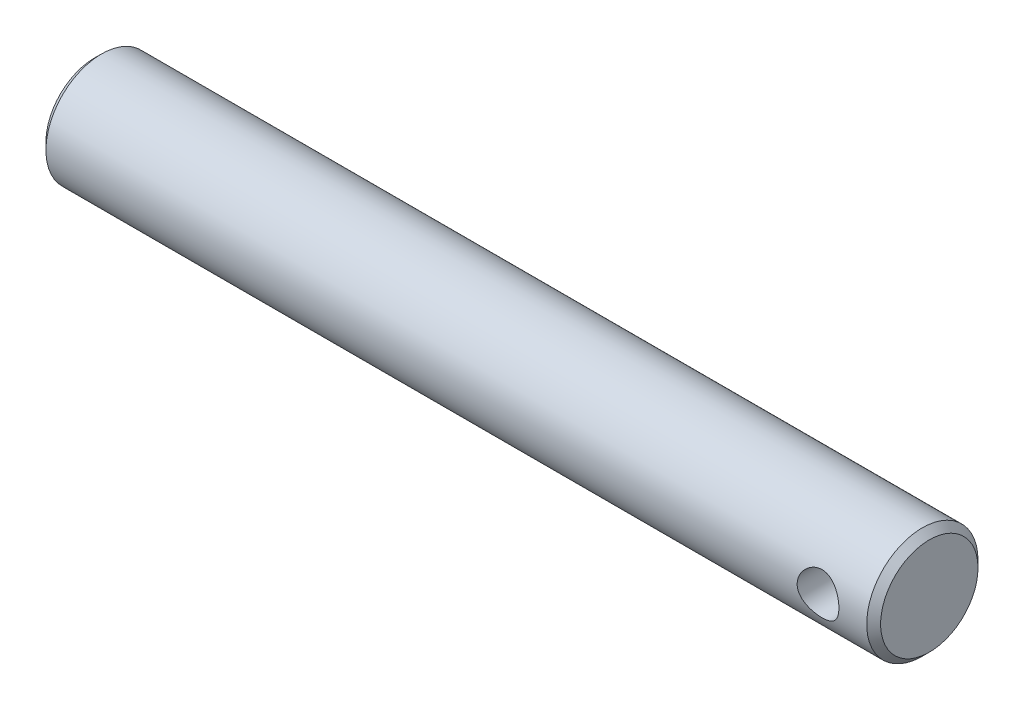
ISO-10303-21;
HEADER;
FILE_DESCRIPTION(('STEP AP214'),'2;1');
FILE_NAME('part.step','',(''),(''),'','','');
FILE_SCHEMA(('AUTOMOTIVE_DESIGN { 1 0 10303 214 1 1 1 1 }'));
ENDSEC;
DATA;
#1=APPLICATION_CONTEXT('core data for automotive mechanical design processes');
#2=APPLICATION_PROTOCOL_DEFINITION('international standard','automotive_design',2000,#1);
#3=PRODUCT_CONTEXT('',#1,'mechanical');
#4=PRODUCT('Part','Part','',(#3));
#5=PRODUCT_RELATED_PRODUCT_CATEGORY('part','',(#4));
#6=PRODUCT_DEFINITION_FORMATION('','',#4);
#7=PRODUCT_DEFINITION_CONTEXT('part definition',#1,'design');
#8=PRODUCT_DEFINITION('design','',#6,#7);
#9=PRODUCT_DEFINITION_SHAPE('','',#8);
#10=(LENGTH_UNIT() NAMED_UNIT(*) SI_UNIT(.MILLI.,.METRE.));
#11=(NAMED_UNIT(*) PLANE_ANGLE_UNIT() SI_UNIT($,.RADIAN.));
#12=(NAMED_UNIT(*) SI_UNIT($,.STERADIAN.) SOLID_ANGLE_UNIT());
#13=UNCERTAINTY_MEASURE_WITH_UNIT(LENGTH_MEASURE(1.E-05),#10,'distance_accuracy_value','');
#14=(GEOMETRIC_REPRESENTATION_CONTEXT(3) GLOBAL_UNCERTAINTY_ASSIGNED_CONTEXT((#13)) GLOBAL_UNIT_ASSIGNED_CONTEXT((#10,
#11,#12)) REPRESENTATION_CONTEXT('',''));
#15=CARTESIAN_POINT('',(0.,0.,0.));
#16=DIRECTION('',(0.,0.,1.));
#17=DIRECTION('',(1.,0.,0.));
#18=AXIS2_PLACEMENT_3D('',#15,#16,#17);
#19=CARTESIAN_POINT('',(95.25,0.,0.));
#20=DIRECTION('',(-1.,0.,0.));
#21=DIRECTION('',(0.,0.,1.));
#22=AXIS2_PLACEMENT_3D('',#19,#20,#21);
#23=CYLINDRICAL_SURFACE('',#22,6.35);
#24=CARTESIAN_POINT('',(94.45625,0.,0.));
#25=DIRECTION('',(1.,0.,0.));
#26=DIRECTION('',(0.,0.,-1.));
#27=AXIS2_PLACEMENT_3D('',#24,#25,#26);
#28=CIRCLE('',#27,6.35);
#29=CARTESIAN_POINT('',(94.45625,0.,-6.35));
#30=VERTEX_POINT('',#29);
#31=EDGE_CURVE('E33',#30,#30,#28,.F.);
#32=ORIENTED_EDGE('',*,*,#31,.T.);
#33=EDGE_LOOP('',(#32));
#34=FACE_BOUND('',#33,.T.);
#35=CARTESIAN_POINT('',(0.793750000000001,0.,0.));
#36=DIRECTION('',(1.,0.,0.));
#37=DIRECTION('',(0.,0.,-1.));
#38=AXIS2_PLACEMENT_3D('',#35,#36,#37);
#39=CIRCLE('',#38,6.35);
#40=CARTESIAN_POINT('',(0.793750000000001,0.,-6.35));
#41=VERTEX_POINT('',#40);
#42=EDGE_CURVE('E37',#41,#41,#39,.T.);
#43=ORIENTED_EDGE('',*,*,#42,.T.);
#44=EDGE_LOOP('',(#43));
#45=FACE_BOUND('',#44,.T.);
#46=CARTESIAN_POINT('',(91.28125,0.,-6.35));
#47=CARTESIAN_POINT('',(91.2812546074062,0.128960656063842,-6.3500034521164));
#48=CARTESIAN_POINT('',(91.2707411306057,0.257889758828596,-6.34603727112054));
#49=CARTESIAN_POINT('',(91.229135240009,0.511894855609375,-6.33061179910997));
#50=CARTESIAN_POINT('',(91.198045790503,0.636971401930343,-6.31915358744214));
#51=CARTESIAN_POINT('',(91.1165421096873,0.879571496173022,-6.28997396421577));
#52=CARTESIAN_POINT('',(91.0661651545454,0.997109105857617,-6.27226463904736));
#53=CARTESIAN_POINT('',(90.9477060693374,1.2220564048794,-6.23234668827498));
#54=CARTESIAN_POINT('',(90.8796191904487,1.32946336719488,-6.21013685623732));
#55=CARTESIAN_POINT('',(90.7246526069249,1.53566243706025,-6.16245667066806));
#56=CARTESIAN_POINT('',(90.6371532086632,1.63396728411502,-6.13689404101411));
#57=CARTESIAN_POINT('',(90.4471609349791,1.81490019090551,-6.08584350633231));
#58=CARTESIAN_POINT('',(90.3446634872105,1.89752345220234,-6.06035562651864));
#59=CARTESIAN_POINT('',(90.1228235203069,2.04784646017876,-6.01126672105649));
#60=CARTESIAN_POINT('',(90.0029880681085,2.11485786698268,-5.98777455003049));
#61=CARTESIAN_POINT('',(89.7527282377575,2.22755851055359,-5.94677278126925));
#62=CARTESIAN_POINT('',(89.6223081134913,2.27325626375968,-5.92926079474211));
#63=CARTESIAN_POINT('',(89.3601896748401,2.3401088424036,-5.90318880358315));
#64=CARTESIAN_POINT('',(89.2287632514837,2.36219354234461,-5.89429104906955));
#65=CARTESIAN_POINT('',(88.9637918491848,2.38410045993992,-5.88546672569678));
#66=CARTESIAN_POINT('',(88.8302477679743,2.38393187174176,-5.88553645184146));
#67=CARTESIAN_POINT('',(88.5733408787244,2.36204807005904,-5.89434799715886));
#68=CARTESIAN_POINT('',(88.4498470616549,2.34162296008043,-5.90257056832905));
#69=CARTESIAN_POINT('',(88.2081878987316,2.28193866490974,-5.92589839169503));
#70=CARTESIAN_POINT('',(88.0900233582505,2.24267664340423,-5.94100468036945));
#71=CARTESIAN_POINT('',(87.8597476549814,2.14572450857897,-5.97671052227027));
#72=CARTESIAN_POINT('',(87.7477933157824,2.08769979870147,-5.99740859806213));
#73=CARTESIAN_POINT('',(87.5348361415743,1.95510267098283,-6.04193308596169));
#74=CARTESIAN_POINT('',(87.4338371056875,1.88052453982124,-6.06576057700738));
#75=CARTESIAN_POINT('',(87.2385166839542,1.71103576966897,-6.11581261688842));
#76=CARTESIAN_POINT('',(87.1451002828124,1.61509549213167,-6.14209064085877));
#77=CARTESIAN_POINT('',(86.9754134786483,1.4086087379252,-6.19270618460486));
#78=CARTESIAN_POINT('',(86.8991457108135,1.29806002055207,-6.21704340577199));
#79=CARTESIAN_POINT('',(86.7649229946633,1.06318595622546,-6.26151901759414));
#80=CARTESIAN_POINT('',(86.7072694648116,0.938674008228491,-6.2815866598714));
#81=CARTESIAN_POINT('',(86.6140276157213,0.680778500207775,-6.31473715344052));
#82=CARTESIAN_POINT('',(86.5784294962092,0.547398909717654,-6.3278231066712));
#83=CARTESIAN_POINT('',(86.5320488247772,0.283170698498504,-6.34499053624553));
#84=CARTESIAN_POINT('',(86.5200476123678,0.152564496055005,-6.34951373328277));
#85=CARTESIAN_POINT('',(86.5176529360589,-0.108858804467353,-6.3504110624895));
#86=CARTESIAN_POINT('',(86.5272546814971,-0.239675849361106,-6.34678700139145));
#87=CARTESIAN_POINT('',(86.566867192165,-0.492541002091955,-6.33208839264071));
#88=CARTESIAN_POINT('',(86.5960795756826,-0.614732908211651,-6.32130547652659));
#89=CARTESIAN_POINT('',(86.6730328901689,-0.852395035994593,-6.29366719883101));
#90=CARTESIAN_POINT('',(86.7207762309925,-0.967864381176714,-6.27681104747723));
#91=CARTESIAN_POINT('',(86.8349584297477,-1.19260582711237,-6.23807528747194));
#92=CARTESIAN_POINT('',(86.9019053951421,-1.30159614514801,-6.2160626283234));
#93=CARTESIAN_POINT('',(87.0520199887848,-1.50716092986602,-6.16944841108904));
#94=CARTESIAN_POINT('',(87.1351936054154,-1.60373079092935,-6.14484589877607));
#95=CARTESIAN_POINT('',(87.3210790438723,-1.78757389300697,-6.09398910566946));
#96=CARTESIAN_POINT('',(87.4246444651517,-1.87398269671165,-6.0677218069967));
#97=CARTESIAN_POINT('',(87.6453215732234,-2.02836541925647,-6.0178761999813));
#98=CARTESIAN_POINT('',(87.7624344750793,-2.09633768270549,-5.99429813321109));
#99=CARTESIAN_POINT('',(88.0078503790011,-2.2119871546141,-5.9525984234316));
#100=CARTESIAN_POINT('',(88.1361977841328,-2.25957900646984,-5.93449982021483));
#101=CARTESIAN_POINT('',(88.3999529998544,-2.33216265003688,-5.9063577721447));
#102=CARTESIAN_POINT('',(88.5353563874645,-2.35716842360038,-5.89630934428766));
#103=CARTESIAN_POINT('',(88.8000131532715,-2.3826207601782,-5.8860673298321));
#104=CARTESIAN_POINT('',(88.9291030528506,-2.38454138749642,-5.88528230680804));
#105=CARTESIAN_POINT('',(89.1856631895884,-2.36754536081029,-5.89213980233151));
#106=CARTESIAN_POINT('',(89.3131335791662,-2.34863068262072,-5.89978152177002));
#107=CARTESIAN_POINT('',(89.5588874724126,-2.29164857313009,-5.92213924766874));
#108=CARTESIAN_POINT('',(89.6773326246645,-2.25418329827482,-5.93663223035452));
#109=CARTESIAN_POINT('',(89.9063249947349,-2.16169393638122,-5.97092957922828));
#110=CARTESIAN_POINT('',(90.0168702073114,-2.106665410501,-5.99073528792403));
#111=CARTESIAN_POINT('',(90.233225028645,-1.97726420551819,-6.03471811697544));
#112=CARTESIAN_POINT('',(90.3384826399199,-1.90202872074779,-6.0590699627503));
#113=CARTESIAN_POINT('',(90.5353497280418,-1.73568496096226,-6.10879916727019));
#114=CARTESIAN_POINT('',(90.626954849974,-1.64457164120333,-6.13417684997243));
#115=CARTESIAN_POINT('',(90.7989706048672,-1.44316512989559,-6.18474799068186));
#116=CARTESIAN_POINT('',(90.8785072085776,-1.33210084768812,-6.20985716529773));
#117=CARTESIAN_POINT('',(91.0177609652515,-1.0973009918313,-6.25561541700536));
#118=CARTESIAN_POINT('',(91.0774765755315,-0.973564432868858,-6.2762641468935));
#119=CARTESIAN_POINT('',(91.1770732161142,-0.711198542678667,-6.31149189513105));
#120=CARTESIAN_POINT('',(91.2159832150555,-0.572156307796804,-6.3257693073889));
#121=CARTESIAN_POINT('',(91.2680625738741,-0.288727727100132,-6.34501909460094));
#122=CARTESIAN_POINT('',(91.2812448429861,-0.144344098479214,-6.34999613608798));
#123=CARTESIAN_POINT('',(91.28125,0.,-6.35));
#124=B_SPLINE_CURVE_WITH_KNOTS('',3,(#46,#47,#48,#49,#50,#51,#52,#53,#54,#55,#56,#57,#58,#59,
#60,#61,#62,#63,#64,#65,#66,#67,#68,#69,#70,#71,#72,#73,#74,#75,#76,#77,#78,#79,#80,#81,#82,#83,
#84,#85,#86,#87,#88,#89,#90,#91,#92,#93,#94,#95,#96,#97,#98,#99,#100,#101,#102,#103,#104,#105,
#106,#107,#108,#109,#110,#111,#112,#113,#114,#115,#116,#117,#118,#119,#120,#121,#122,#123),
.UNSPECIFIED.,.T.,.F.,(4,2,2,2,2,2,2,2,2,2,2,2,2,2,2,2,2,2,2,2,2,2,2,2,2,2,2,2,2,2,2,2,2,2,2,2,
2,2,4),(0.,0.38634955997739,0.772643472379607,1.15819454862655,1.54384911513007,1.9442686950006,
2.34481060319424,2.76060970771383,3.17624252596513,3.57482575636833,3.97324430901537,
4.34781872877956,4.72244956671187,5.10416823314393,5.48601885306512,5.89353268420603,
6.30110909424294,6.71498808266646,7.12868303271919,7.52038468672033,7.91199948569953,
8.28856670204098,8.66518290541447,9.05286514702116,9.44069073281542,9.85101724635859,
10.2613805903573,10.6734461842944,11.0852565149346,11.470620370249,11.8559476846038,
12.2295148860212,12.6031765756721,12.9964254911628,13.3897995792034,13.8044607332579,
14.219154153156,14.6518076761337,15.0842440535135),.UNSPECIFIED.);
#125=CARTESIAN_POINT('',(91.28125,0.,-6.35));
#126=VERTEX_POINT('',#125);
#127=EDGE_CURVE('E52',#126,#126,#124,.T.);
#128=ORIENTED_EDGE('',*,*,#127,.T.);
#129=EDGE_LOOP('',(#128));
#130=FACE_BOUND('',#129,.T.);
#131=CARTESIAN_POINT('',(91.28125,0.,6.35));
#132=CARTESIAN_POINT('',(91.2812546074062,-0.128960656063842,6.3500034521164));
#133=CARTESIAN_POINT('',(91.2707411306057,-0.257889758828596,6.34603727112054));
#134=CARTESIAN_POINT('',(91.229135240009,-0.511894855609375,6.33061179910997));
#135=CARTESIAN_POINT('',(91.198045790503,-0.636971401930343,6.31915358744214));
#136=CARTESIAN_POINT('',(91.1165421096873,-0.879571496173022,6.28997396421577));
#137=CARTESIAN_POINT('',(91.0661651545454,-0.997109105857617,6.27226463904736));
#138=CARTESIAN_POINT('',(90.9477060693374,-1.2220564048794,6.23234668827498));
#139=CARTESIAN_POINT('',(90.8796191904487,-1.32946336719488,6.21013685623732));
#140=CARTESIAN_POINT('',(90.7246526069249,-1.53566243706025,6.16245667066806));
#141=CARTESIAN_POINT('',(90.6371532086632,-1.63396728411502,6.13689404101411));
#142=CARTESIAN_POINT('',(90.4471609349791,-1.81490019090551,6.08584350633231));
#143=CARTESIAN_POINT('',(90.3446634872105,-1.89752345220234,6.06035562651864));
#144=CARTESIAN_POINT('',(90.1228235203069,-2.04784646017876,6.01126672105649));
#145=CARTESIAN_POINT('',(90.0029880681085,-2.11485786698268,5.98777455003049));
#146=CARTESIAN_POINT('',(89.7527282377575,-2.22755851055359,5.94677278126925));
#147=CARTESIAN_POINT('',(89.6223081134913,-2.27325626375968,5.92926079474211));
#148=CARTESIAN_POINT('',(89.3601896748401,-2.3401088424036,5.90318880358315));
#149=CARTESIAN_POINT('',(89.2287632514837,-2.36219354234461,5.89429104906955));
#150=CARTESIAN_POINT('',(88.9637918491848,-2.38410045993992,5.88546672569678));
#151=CARTESIAN_POINT('',(88.8302477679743,-2.38393187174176,5.88553645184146));
#152=CARTESIAN_POINT('',(88.5733408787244,-2.36204807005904,5.89434799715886));
#153=CARTESIAN_POINT('',(88.4498470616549,-2.34162296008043,5.90257056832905));
#154=CARTESIAN_POINT('',(88.2081878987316,-2.28193866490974,5.92589839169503));
#155=CARTESIAN_POINT('',(88.0900233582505,-2.24267664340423,5.94100468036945));
#156=CARTESIAN_POINT('',(87.8597476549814,-2.14572450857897,5.97671052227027));
#157=CARTESIAN_POINT('',(87.7477933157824,-2.08769979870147,5.99740859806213));
#158=CARTESIAN_POINT('',(87.5348361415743,-1.95510267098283,6.04193308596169));
#159=CARTESIAN_POINT('',(87.4338371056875,-1.88052453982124,6.06576057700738));
#160=CARTESIAN_POINT('',(87.2385166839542,-1.71103576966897,6.11581261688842));
#161=CARTESIAN_POINT('',(87.1451002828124,-1.61509549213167,6.14209064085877));
#162=CARTESIAN_POINT('',(86.9754134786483,-1.4086087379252,6.19270618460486));
#163=CARTESIAN_POINT('',(86.8991457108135,-1.29806002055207,6.21704340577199));
#164=CARTESIAN_POINT('',(86.7649229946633,-1.06318595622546,6.26151901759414));
#165=CARTESIAN_POINT('',(86.7072694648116,-0.938674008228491,6.2815866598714));
#166=CARTESIAN_POINT('',(86.6140276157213,-0.680778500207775,6.31473715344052));
#167=CARTESIAN_POINT('',(86.5784294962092,-0.547398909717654,6.3278231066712));
#168=CARTESIAN_POINT('',(86.5320488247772,-0.283170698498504,6.34499053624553));
#169=CARTESIAN_POINT('',(86.5200476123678,-0.152564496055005,6.34951373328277));
#170=CARTESIAN_POINT('',(86.5176529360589,0.108858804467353,6.3504110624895));
#171=CARTESIAN_POINT('',(86.5272546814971,0.239675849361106,6.34678700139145));
#172=CARTESIAN_POINT('',(86.566867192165,0.492541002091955,6.33208839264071));
#173=CARTESIAN_POINT('',(86.5960795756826,0.614732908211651,6.32130547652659));
#174=CARTESIAN_POINT('',(86.6730328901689,0.852395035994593,6.29366719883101));
#175=CARTESIAN_POINT('',(86.7207762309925,0.967864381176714,6.27681104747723));
#176=CARTESIAN_POINT('',(86.8349584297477,1.19260582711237,6.23807528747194));
#177=CARTESIAN_POINT('',(86.9019053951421,1.30159614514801,6.2160626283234));
#178=CARTESIAN_POINT('',(87.0520199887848,1.50716092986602,6.16944841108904));
#179=CARTESIAN_POINT('',(87.1351936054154,1.60373079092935,6.14484589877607));
#180=CARTESIAN_POINT('',(87.3210790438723,1.78757389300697,6.09398910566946));
#181=CARTESIAN_POINT('',(87.4246444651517,1.87398269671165,6.0677218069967));
#182=CARTESIAN_POINT('',(87.6453215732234,2.02836541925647,6.0178761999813));
#183=CARTESIAN_POINT('',(87.7624344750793,2.09633768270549,5.99429813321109));
#184=CARTESIAN_POINT('',(88.0078503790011,2.2119871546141,5.9525984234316));
#185=CARTESIAN_POINT('',(88.1361977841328,2.25957900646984,5.93449982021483));
#186=CARTESIAN_POINT('',(88.3999529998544,2.33216265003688,5.9063577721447));
#187=CARTESIAN_POINT('',(88.5353563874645,2.35716842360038,5.89630934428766));
#188=CARTESIAN_POINT('',(88.8000131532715,2.3826207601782,5.8860673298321));
#189=CARTESIAN_POINT('',(88.9291030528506,2.38454138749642,5.88528230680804));
#190=CARTESIAN_POINT('',(89.1856631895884,2.36754536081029,5.89213980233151));
#191=CARTESIAN_POINT('',(89.3131335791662,2.34863068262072,5.89978152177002));
#192=CARTESIAN_POINT('',(89.5588874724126,2.29164857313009,5.92213924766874));
#193=CARTESIAN_POINT('',(89.6773326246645,2.25418329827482,5.93663223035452));
#194=CARTESIAN_POINT('',(89.9063249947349,2.16169393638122,5.97092957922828));
#195=CARTESIAN_POINT('',(90.0168702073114,2.106665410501,5.99073528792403));
#196=CARTESIAN_POINT('',(90.233225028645,1.97726420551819,6.03471811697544));
#197=CARTESIAN_POINT('',(90.3384826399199,1.90202872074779,6.0590699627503));
#198=CARTESIAN_POINT('',(90.5353497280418,1.73568496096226,6.10879916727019));
#199=CARTESIAN_POINT('',(90.626954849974,1.64457164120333,6.13417684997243));
#200=CARTESIAN_POINT('',(90.7989706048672,1.44316512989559,6.18474799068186));
#201=CARTESIAN_POINT('',(90.8785072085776,1.33210084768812,6.20985716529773));
#202=CARTESIAN_POINT('',(91.0177609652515,1.0973009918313,6.25561541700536));
#203=CARTESIAN_POINT('',(91.0774765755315,0.973564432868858,6.2762641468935));
#204=CARTESIAN_POINT('',(91.1770732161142,0.711198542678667,6.31149189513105));
#205=CARTESIAN_POINT('',(91.2159832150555,0.572156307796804,6.3257693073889));
#206=CARTESIAN_POINT('',(91.2680625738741,0.288727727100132,6.34501909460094));
#207=CARTESIAN_POINT('',(91.2812448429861,0.144344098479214,6.34999613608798));
#208=CARTESIAN_POINT('',(91.28125,0.,6.35));
#209=B_SPLINE_CURVE_WITH_KNOTS('',3,(#131,#132,#133,#134,#135,#136,#137,#138,#139,#140,#141,
#142,#143,#144,#145,#146,#147,#148,#149,#150,#151,#152,#153,#154,#155,#156,#157,#158,#159,#160,
#161,#162,#163,#164,#165,#166,#167,#168,#169,#170,#171,#172,#173,#174,#175,#176,#177,#178,#179,
#180,#181,#182,#183,#184,#185,#186,#187,#188,#189,#190,#191,#192,#193,#194,#195,#196,#197,#198,
#199,#200,#201,#202,#203,#204,#205,#206,#207,#208),.UNSPECIFIED.,.T.,.F.,(4,2,2,2,2,2,2,2,2,2,2,
2,2,2,2,2,2,2,2,2,2,2,2,2,2,2,2,2,2,2,2,2,2,2,2,2,2,2,4),(0.,0.38634955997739,0.772643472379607,
1.15819454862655,1.54384911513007,1.9442686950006,2.34481060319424,2.76060970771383,
3.17624252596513,3.57482575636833,3.97324430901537,4.34781872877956,4.72244956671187,
5.10416823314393,5.48601885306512,5.89353268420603,6.30110909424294,6.71498808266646,
7.12868303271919,7.52038468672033,7.91199948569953,8.28856670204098,8.66518290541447,
9.05286514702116,9.44069073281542,9.85101724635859,10.2613805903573,10.6734461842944,
11.0852565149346,11.470620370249,11.8559476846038,12.2295148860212,12.6031765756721,
12.9964254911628,13.3897995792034,13.8044607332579,14.219154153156,14.6518076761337,
15.0842440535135),.UNSPECIFIED.);
#210=CARTESIAN_POINT('',(91.28125,0.,6.35));
#211=VERTEX_POINT('',#210);
#212=EDGE_CURVE('E58',#211,#211,#209,.T.);
#213=ORIENTED_EDGE('',*,*,#212,.T.);
#214=EDGE_LOOP('',(#213));
#215=FACE_BOUND('',#214,.T.);
#216=ADVANCED_FACE('F26',(#34,#45,#130,#215),#23,.T.);
#217=CARTESIAN_POINT('',(95.25,0.,0.));
#218=DIRECTION('',(1.,0.,0.));
#219=DIRECTION('',(0.,0.,-1.));
#220=AXIS2_PLACEMENT_3D('',#217,#218,#219);
#221=PLANE('',#220);
#222=CARTESIAN_POINT('',(95.25,0.,0.));
#223=DIRECTION('',(1.,0.,0.));
#224=DIRECTION('',(0.,0.,-1.));
#225=AXIS2_PLACEMENT_3D('',#222,#223,#224);
#226=CIRCLE('',#225,5.55625);
#227=CARTESIAN_POINT('',(95.25,0.,-5.55625));
#228=VERTEX_POINT('',#227);
#229=EDGE_CURVE('E41',#228,#228,#226,.T.);
#230=ORIENTED_EDGE('',*,*,#229,.T.);
#231=EDGE_LOOP('',(#230));
#232=FACE_BOUND('',#231,.T.);
#233=ADVANCED_FACE('F73',(#232),#221,.T.);
#234=CARTESIAN_POINT('',(0.,0.,0.));
#235=DIRECTION('',(1.,0.,0.));
#236=DIRECTION('',(0.,0.,-1.));
#237=AXIS2_PLACEMENT_3D('',#234,#235,#236);
#238=PLANE('',#237);
#239=CARTESIAN_POINT('',(0.,0.,0.));
#240=DIRECTION('',(1.,0.,0.));
#241=DIRECTION('',(0.,0.,-1.));
#242=AXIS2_PLACEMENT_3D('',#239,#240,#241);
#243=CIRCLE('',#242,5.55625);
#244=CARTESIAN_POINT('',(0.,0.,-5.55625));
#245=VERTEX_POINT('',#244);
#246=EDGE_CURVE('E10',#245,#245,#243,.F.);
#247=ORIENTED_EDGE('',*,*,#246,.T.);
#248=EDGE_LOOP('',(#247));
#249=FACE_BOUND('',#248,.T.);
#250=CARTESIAN_POINT('',(0.,0.,0.));
#251=DIRECTION('',(-1.,0.,0.));
#252=DIRECTION('',(0.,0.,1.));
#253=AXIS2_PLACEMENT_3D('',#250,#251,#252);
#254=CIRCLE('',#253,3.556);
#255=CARTESIAN_POINT('',(0.,0.,3.556));
#256=VERTEX_POINT('',#255);
#257=EDGE_CURVE('E110',#256,#256,#254,.T.);
#258=ORIENTED_EDGE('',*,*,#257,.F.);
#259=EDGE_LOOP('',(#258));
#260=FACE_BOUND('',#259,.T.);
#261=ADVANCED_FACE('F68',(#249,#260),#238,.F.);
#262=CARTESIAN_POINT('',(88.9,0.,-6.35));
#263=DIRECTION('',(0.,0.,1.));
#264=DIRECTION('',(1.,0.,0.));
#265=AXIS2_PLACEMENT_3D('',#262,#263,#264);
#266=CYLINDRICAL_SURFACE('',#265,2.38125000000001);
#267=ORIENTED_EDGE('',*,*,#212,.F.);
#268=EDGE_LOOP('',(#267));
#269=FACE_BOUND('',#268,.T.);
#270=ORIENTED_EDGE('',*,*,#127,.F.);
#271=EDGE_LOOP('',(#270));
#272=FACE_BOUND('',#271,.T.);
#273=ADVANCED_FACE('F62',(#269,#272),#266,.F.);
#274=CARTESIAN_POINT('',(31.75,0.,0.));
#275=DIRECTION('',(-1.,0.,0.));
#276=DIRECTION('',(0.,0.,1.));
#277=AXIS2_PLACEMENT_3D('',#274,#275,#276);
#278=CYLINDRICAL_SURFACE('',#277,3.556);
#279=CARTESIAN_POINT('',(30.95625,0.,0.));
#280=DIRECTION('',(-1.,0.,0.));
#281=DIRECTION('',(0.,0.,1.));
#282=AXIS2_PLACEMENT_3D('',#279,#280,#281);
#283=CIRCLE('',#282,3.556);
#284=CARTESIAN_POINT('',(30.95625,0.,3.556));
#285=VERTEX_POINT('',#284);
#286=EDGE_CURVE('E46',#285,#285,#283,.F.);
#287=ORIENTED_EDGE('',*,*,#286,.T.);
#288=EDGE_LOOP('',(#287));
#289=FACE_BOUND('',#288,.T.);
#290=ORIENTED_EDGE('',*,*,#257,.T.);
#291=EDGE_LOOP('',(#290));
#292=FACE_BOUND('',#291,.T.);
#293=ADVANCED_FACE('F67',(#289,#292),#278,.F.);
#294=CARTESIAN_POINT('',(31.75,0.,0.));
#295=DIRECTION('',(-1.,0.,0.));
#296=DIRECTION('',(0.,0.,1.));
#297=AXIS2_PLACEMENT_3D('',#294,#295,#296);
#298=PLANE('',#297);
#299=CARTESIAN_POINT('',(31.75,0.,0.));
#300=DIRECTION('',(-1.,0.,0.));
#301=DIRECTION('',(0.,0.,1.));
#302=AXIS2_PLACEMENT_3D('',#299,#300,#301);
#303=CIRCLE('',#302,2.76225);
#304=CARTESIAN_POINT('',(31.75,0.,2.76225));
#305=VERTEX_POINT('',#304);
#306=EDGE_CURVE('E49',#305,#305,#303,.T.);
#307=ORIENTED_EDGE('',*,*,#306,.T.);
#308=EDGE_LOOP('',(#307));
#309=FACE_BOUND('',#308,.T.);
#310=ADVANCED_FACE('F93',(#309),#298,.T.);
#311=CARTESIAN_POINT('',(31.75,0.,0.));
#312=DIRECTION('',(-1.,0.,0.));
#313=DIRECTION('',(0.,0.,1.));
#314=AXIS2_PLACEMENT_3D('',#311,#312,#313);
#315=CONICAL_SURFACE('',#314,2.76225,0.785398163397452);
#316=ORIENTED_EDGE('',*,*,#286,.F.);
#317=EDGE_LOOP('',(#316));
#318=FACE_BOUND('',#317,.T.);
#319=ORIENTED_EDGE('',*,*,#306,.F.);
#320=EDGE_LOOP('',(#319));
#321=FACE_BOUND('',#320,.T.);
#322=ADVANCED_FACE('F84',(#318,#321),#315,.F.);
#323=CARTESIAN_POINT('',(95.25,0.,0.));
#324=DIRECTION('',(-1.,0.,0.));
#325=DIRECTION('',(0.,0.,1.));
#326=AXIS2_PLACEMENT_3D('',#323,#324,#325);
#327=CONICAL_SURFACE('',#326,5.55625,0.785398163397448);
#328=ORIENTED_EDGE('',*,*,#31,.F.);
#329=EDGE_LOOP('',(#328));
#330=FACE_BOUND('',#329,.T.);
#331=ORIENTED_EDGE('',*,*,#229,.F.);
#332=EDGE_LOOP('',(#331));
#333=FACE_BOUND('',#332,.T.);
#334=ADVANCED_FACE('F81',(#330,#333),#327,.T.);
#335=CARTESIAN_POINT('',(0.793750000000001,0.,0.));
#336=DIRECTION('',(1.,0.,0.));
#337=DIRECTION('',(0.,0.,-1.));
#338=AXIS2_PLACEMENT_3D('',#335,#336,#337);
#339=CONICAL_SURFACE('',#338,6.35,0.78539816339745);
#340=ORIENTED_EDGE('',*,*,#246,.F.);
#341=EDGE_LOOP('',(#340));
#342=FACE_BOUND('',#341,.T.);
#343=ORIENTED_EDGE('',*,*,#42,.F.);
#344=EDGE_LOOP('',(#343));
#345=FACE_BOUND('',#344,.T.);
#346=ADVANCED_FACE('F83',(#342,#345),#339,.T.);
#347=CLOSED_SHELL('',(#216,#233,#261,#273,#293,#310,#322,#334,#346));
#348=MANIFOLD_SOLID_BREP('B2',#347);
#349=ADVANCED_BREP_SHAPE_REPRESENTATION('',(#18,#348),#14);
#350=SHAPE_DEFINITION_REPRESENTATION(#9,#349);
ENDSEC;
END-ISO-10303-21;
